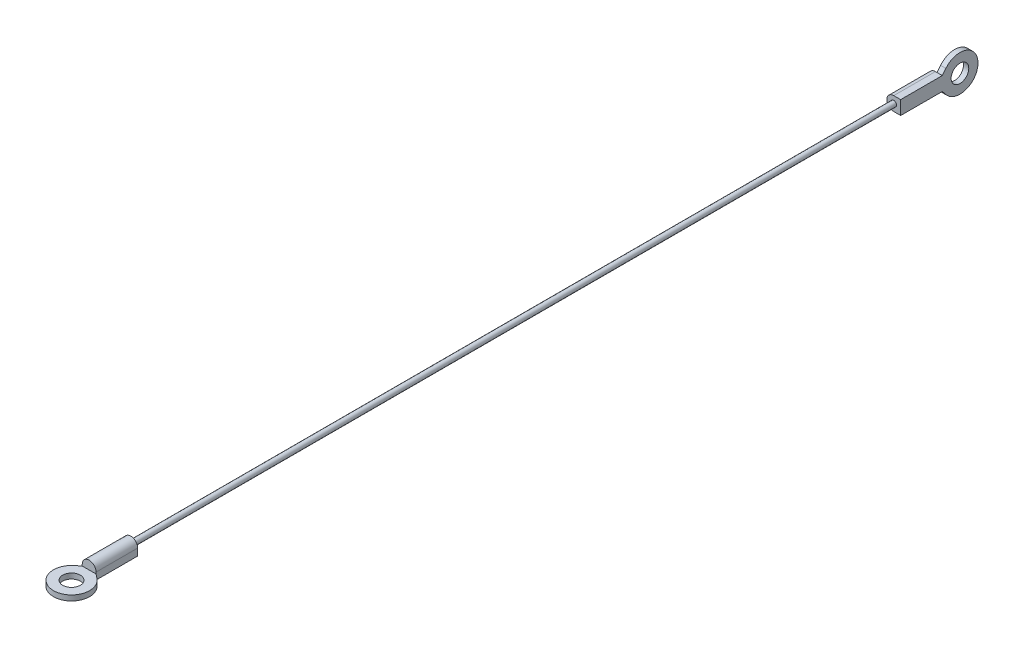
from build123d import *

# Parameters (mm, degrees)
SKETCH1_R           = 0.795
BOSS_EXTRUDE1_DEPTH = 109.92
BOSS_EXTRUDE2_DEPTH = 12
SKETCH3_R           = 2.54
BOSS_EXTRUDE3_DEPTH = 1.52
BOSS_EXTRUDE4_START = 12
BOSS_EXTRUDE4_DEPTH = 12
SKETCH5_R           = 2.54
BOSS_EXTRUDE5_DEPTH = 1.52


with BuildPart() as part:
    # Sketch1 → Boss-Extrude1 (new, symmetric)
    with BuildSketch(Plane.XY):
        with Locations(Location((0, 0, 0), (0, 0, 180))):
            Circle(SKETCH1_R)
    extrude(amount=BOSS_EXTRUDE1_DEPTH, both=True)

    # Sketch2 → Boss-Extrude2 (add)
    with BuildSketch(Plane.XY.offset(109.92)):
        with BuildLine():
            Line((-1.99, 0), (-1.99, -1.99))
            Line((-1.99, -1.99), (0, -1.99))
            Line((0, -1.99), (1.99, -1.99))
            Line((1.99, -1.99), (1.99, 0))
            ThreePointArc((1.99, 0), (0, 1.99), (-1.99, 0))
        make_face()
    extrude(amount=BOSS_EXTRUDE2_DEPTH)

    # Sketch3 → Boss-Extrude3 (add)
    with BuildSketch(Plane.XZ.offset(1.99)):
        with BuildLine():
            Line((1.99, 121.92), (3.263901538, 122.945499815))
            ThreePointArc((3.263901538, 122.945499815), (0, 132.205), (-3.263901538, 122.945499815))
            Line((-3.263901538, 122.945499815), (-1.99, 121.92))
            Line((-1.99, 121.92), (1.99, 121.92))
        make_face()
        with Locations(Location((0, 127, 0), (0, 0, 270))):
            Circle(SKETCH3_R, mode=Mode.SUBTRACT)
    extrude(amount=-BOSS_EXTRUDE3_DEPTH)

    # Sketch4 → Boss-Extrude4 (add)
    with BuildSketch(Plane(origin=(0, 0, -109.92), x_dir=(-1, 0, 0), z_dir=(0, 0, -1)).offset(BOSS_EXTRUDE4_START)):
        with BuildLine():
            Line((0, 1.99), (-1.99, 1.99))
            Line((-1.99, 1.99), (-1.99, 0))
            Line((-1.99, 0), (-1.99, -1.99))
            Line((-1.99, -1.99), (0, -1.99))
            ThreePointArc((0, -1.99), (1.99, 0), (0, 1.99))
        make_face()
    extrude(amount=-BOSS_EXTRUDE4_DEPTH)

    # Sketch5 → Boss-Extrude5 (add)
    with BuildSketch(Plane(origin=(1.99, 0, 0), x_dir=(0, 0, -1), z_dir=(1, 0, 0))):
        with BuildLine():
            Line((121.92, -1.99), (121.92, 1.99))
            Line((121.92, 1.99), (122.945499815, 3.263901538))
            ThreePointArc((122.945499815, 3.263901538), (132.205, 0), (122.945499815, -3.263901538))
            Line((122.945499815, -3.263901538), (121.92, -1.99))
        make_face()
        with Locations((127, 0)):
            Circle(SKETCH5_R, mode=Mode.SUBTRACT)
    extrude(amount=-BOSS_EXTRUDE5_DEPTH)


solid = part.part
